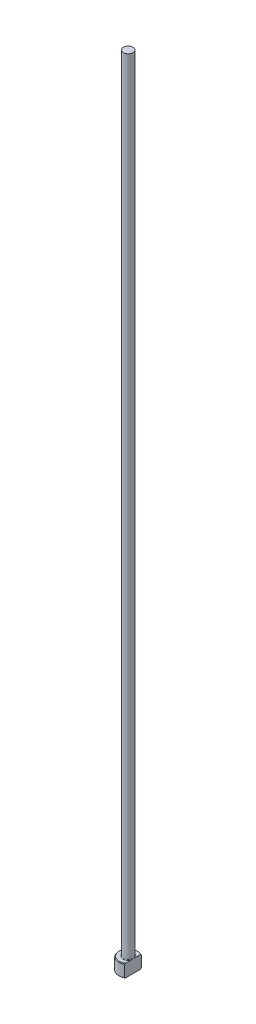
ISO-10303-21;
HEADER;
FILE_DESCRIPTION(('STEP AP214'),'2;1');
FILE_NAME('part.step','',(''),(''),'','','');
FILE_SCHEMA(('AUTOMOTIVE_DESIGN { 1 0 10303 214 1 1 1 1 }'));
ENDSEC;
DATA;
#1=APPLICATION_CONTEXT('core data for automotive mechanical design processes');
#2=APPLICATION_PROTOCOL_DEFINITION('international standard','automotive_design',2000,#1);
#3=PRODUCT_CONTEXT('',#1,'mechanical');
#4=PRODUCT('Part','Part','',(#3));
#5=PRODUCT_RELATED_PRODUCT_CATEGORY('part','',(#4));
#6=PRODUCT_DEFINITION_FORMATION('','',#4);
#7=PRODUCT_DEFINITION_CONTEXT('part definition',#1,'design');
#8=PRODUCT_DEFINITION('design','',#6,#7);
#9=PRODUCT_DEFINITION_SHAPE('','',#8);
#10=(LENGTH_UNIT() NAMED_UNIT(*) SI_UNIT(.MILLI.,.METRE.));
#11=(NAMED_UNIT(*) PLANE_ANGLE_UNIT() SI_UNIT($,.RADIAN.));
#12=(NAMED_UNIT(*) SI_UNIT($,.STERADIAN.) SOLID_ANGLE_UNIT());
#13=UNCERTAINTY_MEASURE_WITH_UNIT(LENGTH_MEASURE(1.E-05),#10,'distance_accuracy_value','');
#14=(GEOMETRIC_REPRESENTATION_CONTEXT(3) GLOBAL_UNCERTAINTY_ASSIGNED_CONTEXT((#13)) GLOBAL_UNIT_ASSIGNED_CONTEXT((#10,
#11,#12)) REPRESENTATION_CONTEXT('',''));
#15=CARTESIAN_POINT('',(0.,0.,0.));
#16=DIRECTION('',(0.,0.,1.));
#17=DIRECTION('',(1.,0.,0.));
#18=AXIS2_PLACEMENT_3D('',#15,#16,#17);
#19=CARTESIAN_POINT('',(0.,0.,0.));
#20=DIRECTION('',(0.,-1.,0.));
#21=DIRECTION('',(0.,0.,-1.));
#22=AXIS2_PLACEMENT_3D('',#19,#20,#21);
#23=PLANE('',#22);
#24=CARTESIAN_POINT('',(0.,0.,0.));
#25=DIRECTION('',(0.,-1.,0.));
#26=DIRECTION('',(0.,0.,-1.));
#27=AXIS2_PLACEMENT_3D('',#24,#25,#26);
#28=CIRCLE('',#27,2.8);
#29=CARTESIAN_POINT('',(1.49999999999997,0.,2.36431808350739));
#30=VERTEX_POINT('',#29);
#31=CARTESIAN_POINT('',(1.49999999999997,0.,-2.36431808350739));
#32=VERTEX_POINT('',#31);
#33=EDGE_CURVE('E98',#30,#32,#28,.T.);
#34=ORIENTED_EDGE('',*,*,#33,.T.);
#35=DIRECTION('',(0.,0.,1.));
#36=VECTOR('',#35,1.);
#37=CARTESIAN_POINT('',(1.49999999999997,0.,2.5980762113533));
#38=LINE('',#37,#36);
#39=EDGE_CURVE('E83',#32,#30,#38,.T.);
#40=ORIENTED_EDGE('',*,*,#39,.T.);
#41=EDGE_LOOP('',(#34,#40));
#42=FACE_BOUND('',#41,.T.);
#43=ADVANCED_FACE('F32',(#42),#23,.T.);
#44=CARTESIAN_POINT('',(0.,259.958771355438,0.));
#45=DIRECTION('',(0.,1.,0.));
#46=DIRECTION('',(0.,0.,1.));
#47=AXIS2_PLACEMENT_3D('',#44,#45,#46);
#48=CYLINDRICAL_SURFACE('',#47,2.99999999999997);
#49=CARTESIAN_POINT('',(0.,3.80000000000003,0.));
#50=DIRECTION('',(0.,1.,0.));
#51=DIRECTION('',(0.,0.,1.));
#52=AXIS2_PLACEMENT_3D('',#49,#50,#51);
#53=CIRCLE('',#52,2.99999999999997);
#54=CARTESIAN_POINT('',(1.49999999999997,3.80000000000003,2.5980762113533));
#55=VERTEX_POINT('',#54);
#56=CARTESIAN_POINT('',(1.49999999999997,3.80000000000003,-2.5980762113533));
#57=VERTEX_POINT('',#56);
#58=EDGE_CURVE('E104',#55,#57,#53,.F.);
#59=ORIENTED_EDGE('',*,*,#58,.T.);
#60=DIRECTION('',(0.,-1.,0.));
#61=VECTOR('',#60,1.);
#62=CARTESIAN_POINT('',(1.49999999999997,250.,-2.5980762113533));
#63=LINE('',#62,#61);
#64=CARTESIAN_POINT('',(1.49999999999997,0.199999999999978,-2.5980762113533));
#65=VERTEX_POINT('',#64);
#66=EDGE_CURVE('E183',#57,#65,#63,.T.);
#67=ORIENTED_EDGE('',*,*,#66,.T.);
#68=CARTESIAN_POINT('',(0.,0.199999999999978,0.));
#69=DIRECTION('',(0.,-1.,0.));
#70=DIRECTION('',(0.,0.,-1.));
#71=AXIS2_PLACEMENT_3D('',#68,#69,#70);
#72=CIRCLE('',#71,2.99999999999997);
#73=CARTESIAN_POINT('',(1.49999999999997,0.199999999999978,2.5980762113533));
#74=VERTEX_POINT('',#73);
#75=EDGE_CURVE('E100',#65,#74,#72,.F.);
#76=ORIENTED_EDGE('',*,*,#75,.T.);
#77=DIRECTION('',(0.,-1.,0.));
#78=VECTOR('',#77,1.);
#79=CARTESIAN_POINT('',(1.49999999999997,250.,2.5980762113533));
#80=LINE('',#79,#78);
#81=EDGE_CURVE('E93',#55,#74,#80,.T.);
#82=ORIENTED_EDGE('',*,*,#81,.F.);
#83=EDGE_LOOP('',(#59,#67,#76,#82));
#84=FACE_BOUND('',#83,.T.);
#85=ADVANCED_FACE('F158',(#84),#48,.T.);
#86=CARTESIAN_POINT('',(-2.99999999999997,4.,0.));
#87=DIRECTION('',(0.,1.,0.));
#88=DIRECTION('',(0.,0.,1.));
#89=AXIS2_PLACEMENT_3D('',#86,#87,#88);
#90=PLANE('',#89);
#91=CARTESIAN_POINT('',(0.,4.,0.));
#92=DIRECTION('',(0.,1.,0.));
#93=DIRECTION('',(0.,0.,1.));
#94=AXIS2_PLACEMENT_3D('',#91,#92,#93);
#95=CIRCLE('',#94,2.80000000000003);
#96=CARTESIAN_POINT('',(1.49999999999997,4.,-2.36431808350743));
#97=VERTEX_POINT('',#96);
#98=CARTESIAN_POINT('',(1.49999999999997,4.,2.36431808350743));
#99=VERTEX_POINT('',#98);
#100=EDGE_CURVE('E178',#97,#99,#95,.T.);
#101=ORIENTED_EDGE('',*,*,#100,.T.);
#102=DIRECTION('',(0.,0.,-1.));
#103=VECTOR('',#102,1.);
#104=CARTESIAN_POINT('',(1.49999999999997,4.,0.));
#105=LINE('',#104,#103);
#106=CARTESIAN_POINT('',(1.49999999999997,3.99999999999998,0.799999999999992));
#107=VERTEX_POINT('',#106);
#108=EDGE_CURVE('E57',#99,#107,#105,.T.);
#109=ORIENTED_EDGE('',*,*,#108,.T.);
#110=CARTESIAN_POINT('',(0.,4.,0.));
#111=DIRECTION('',(0.,1.,0.));
#112=DIRECTION('',(0.,0.,1.));
#113=AXIS2_PLACEMENT_3D('',#110,#111,#112);
#114=CIRCLE('',#113,1.69999999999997);
#115=CARTESIAN_POINT('',(1.49999999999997,3.99999999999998,-0.799999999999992));
#116=VERTEX_POINT('',#115);
#117=EDGE_CURVE('E107',#107,#116,#114,.F.);
#118=ORIENTED_EDGE('',*,*,#117,.T.);
#119=EDGE_CURVE('E136',#116,#97,#105,.T.);
#120=ORIENTED_EDGE('',*,*,#119,.T.);
#121=EDGE_LOOP('',(#101,#109,#118,#120));
#122=FACE_BOUND('',#121,.T.);
#123=ADVANCED_FACE('F147',(#122),#90,.T.);
#124=CARTESIAN_POINT('',(0.,4.,0.));
#125=DIRECTION('',(0.,-1.,0.));
#126=DIRECTION('',(0.,0.,-1.));
#127=AXIS2_PLACEMENT_3D('',#124,#125,#126);
#128=CONICAL_SURFACE('',#127,2.80000000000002,0.785398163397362);
#129=ORIENTED_EDGE('',*,*,#58,.F.);
#130=CARTESIAN_POINT('',(1.49999999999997,0.888258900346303,5.71827621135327));
#131=CARTESIAN_POINT('',(1.49999999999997,1.01361833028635,5.58866816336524));
#132=CARTESIAN_POINT('',(1.49999999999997,1.13884324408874,5.45892957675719));
#133=CARTESIAN_POINT('',(1.49999999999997,1.38894444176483,5.19911365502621));
#134=CARTESIAN_POINT('',(1.49999999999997,1.51382072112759,5.0690363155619));
#135=CARTESIAN_POINT('',(1.49999999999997,1.76320568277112,4.80840180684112));
#136=CARTESIAN_POINT('',(1.49999999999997,1.88771414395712,4.67784442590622));
#137=CARTESIAN_POINT('',(1.49999999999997,2.13618059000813,4.41620813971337));
#138=CARTESIAN_POINT('',(1.49999999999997,2.26013857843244,4.28512923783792));
#139=CARTESIAN_POINT('',(1.49999999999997,2.50488975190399,4.02490837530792));
#140=CARTESIAN_POINT('',(1.49999999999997,2.62569693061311,3.89577958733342));
#141=CARTESIAN_POINT('',(1.49999999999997,2.86640694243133,3.63668213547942));
#142=CARTESIAN_POINT('',(1.49999999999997,2.98630978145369,3.50671347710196));
#143=CARTESIAN_POINT('',(1.49999999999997,3.2248603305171,3.24567921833));
#144=CARTESIAN_POINT('',(1.49999999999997,3.34350830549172,3.11461386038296));
#145=CARTESIAN_POINT('',(1.49999999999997,3.57907716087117,2.85094268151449));
#146=CARTESIAN_POINT('',(1.49999999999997,3.69599811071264,2.71833692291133));
#147=CARTESIAN_POINT('',(1.49999999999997,3.88262371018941,2.50255231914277));
#148=CARTESIAN_POINT('',(1.49999999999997,3.95312454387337,2.42006293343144));
#149=CARTESIAN_POINT('',(1.49999999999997,4.0928709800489,2.25401084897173));
#150=CARTESIAN_POINT('',(1.49999999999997,4.16211645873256,2.17044804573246));
#151=CARTESIAN_POINT('',(1.49999999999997,4.29964684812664,2.00105967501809));
#152=CARTESIAN_POINT('',(1.49999999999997,4.36791386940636,1.91521952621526));
#153=CARTESIAN_POINT('',(1.49999999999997,4.50205840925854,1.74171392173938));
#154=CARTESIAN_POINT('',(1.49999999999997,4.56793649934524,1.65404891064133));
#155=CARTESIAN_POINT('',(1.49999999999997,4.69728151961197,1.47490236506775));
#156=CARTESIAN_POINT('',(1.49999999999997,4.76069661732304,1.3833830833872));
#157=CARTESIAN_POINT('',(1.49999999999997,4.88239539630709,1.19675661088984));
#158=CARTESIAN_POINT('',(1.49999999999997,4.94067201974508,1.10164473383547));
#159=CARTESIAN_POINT('',(1.49999999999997,5.04841325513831,0.908008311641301));
#160=CARTESIAN_POINT('',(1.49999999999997,5.09797809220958,0.809540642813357));
#161=CARTESIAN_POINT('',(1.49999999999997,5.18432188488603,0.607192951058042));
#162=CARTESIAN_POINT('',(1.49999999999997,5.22114374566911,0.503332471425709));
#163=CARTESIAN_POINT('',(1.49999999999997,5.26099935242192,0.347577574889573));
#164=CARTESIAN_POINT('',(1.49999999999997,5.27157029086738,0.297609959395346));
#165=CARTESIAN_POINT('',(1.49999999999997,5.28794860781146,0.19688506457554));
#166=CARTESIAN_POINT('',(1.49999999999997,5.29375640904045,0.146127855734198));
#167=CARTESIAN_POINT('',(1.49999999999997,5.30019707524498,0.0444388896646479));
#168=CARTESIAN_POINT('',(1.49999999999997,5.30084594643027,-0.00649183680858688));
#169=CARTESIAN_POINT('',(1.49999999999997,5.29696416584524,-0.108155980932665));
#170=CARTESIAN_POINT('',(1.49999999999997,5.29243308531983,-0.158889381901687));
#171=CARTESIAN_POINT('',(1.49999999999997,5.27856915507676,-0.259234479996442));
#172=CARTESIAN_POINT('',(1.49999999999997,5.26927821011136,-0.308852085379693));
#173=CARTESIAN_POINT('',(1.49999999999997,5.24647108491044,-0.407110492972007));
#174=CARTESIAN_POINT('',(1.49999999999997,5.23295324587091,-0.455750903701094));
#175=CARTESIAN_POINT('',(1.49999999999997,5.20226175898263,-0.552149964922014));
#176=CARTESIAN_POINT('',(1.49999999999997,5.18506801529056,-0.599902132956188));
#177=CARTESIAN_POINT('',(1.49999999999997,5.14771387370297,-0.694205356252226));
#178=CARTESIAN_POINT('',(1.49999999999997,5.12755408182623,-0.740756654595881));
#179=CARTESIAN_POINT('',(1.49999999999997,5.06327696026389,-0.879166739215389));
#180=CARTESIAN_POINT('',(1.49999999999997,5.01551721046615,-0.969329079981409));
#181=CARTESIAN_POINT('',(1.49999999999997,4.91367909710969,-1.14604316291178));
#182=CARTESIAN_POINT('',(1.49999999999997,4.85959300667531,-1.23259031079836));
#183=CARTESIAN_POINT('',(1.49999999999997,4.74697968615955,-1.40321348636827));
#184=CARTESIAN_POINT('',(1.49999999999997,4.68843573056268,-1.48727838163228));
#185=CARTESIAN_POINT('',(1.49999999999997,4.56843845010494,-1.65322187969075));
#186=CARTESIAN_POINT('',(1.49999999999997,4.50698656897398,-1.73510153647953));
#187=CARTESIAN_POINT('',(1.49999999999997,4.3811567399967,-1.89829823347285));
#188=CARTESIAN_POINT('',(1.49999999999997,4.31675092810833,-1.97959369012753));
#189=CARTESIAN_POINT('',(1.49999999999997,4.18634068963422,-2.14090082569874));
#190=CARTESIAN_POINT('',(1.49999999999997,4.12033609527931,-2.22091236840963));
#191=CARTESIAN_POINT('',(1.49999999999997,3.92086431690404,-2.4590650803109));
#192=CARTESIAN_POINT('',(1.49999999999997,3.78562663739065,-2.61572090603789));
#193=CARTESIAN_POINT('',(1.49999999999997,3.53554498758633,-2.90006295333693));
#194=CARTESIAN_POINT('',(1.49999999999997,3.42114543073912,-3.02814382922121));
#195=CARTESIAN_POINT('',(1.49999999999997,3.19093557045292,-3.28303767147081));
#196=CARTESIAN_POINT('',(1.49999999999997,3.07512522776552,-3.40985060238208));
#197=CARTESIAN_POINT('',(1.49999999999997,2.72597067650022,-3.7891384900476));
#198=CARTESIAN_POINT('',(1.49999999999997,2.49111760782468,-4.04022177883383));
#199=CARTESIAN_POINT('',(1.49999999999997,2.02882478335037,-4.52992803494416));
#200=CARTESIAN_POINT('',(1.49999999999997,1.80147747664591,-4.76863870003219));
#201=CARTESIAN_POINT('',(1.49999999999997,1.45954865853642,-5.12558036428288));
#202=CARTESIAN_POINT('',(1.49999999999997,1.34548484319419,-5.24430773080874));
#203=CARTESIAN_POINT('',(1.49999999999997,1.11707176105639,-5.48148573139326));
#204=CARTESIAN_POINT('',(1.49999999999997,1.00272249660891,-5.59993636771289));
#205=CARTESIAN_POINT('',(1.49999999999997,0.888258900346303,-5.71827621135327));
#206=B_SPLINE_CURVE_WITH_KNOTS('',3,(#130,#131,#132,#133,#134,#135,#136,#137,#138,#139,#140,
#141,#142,#143,#144,#145,#146,#147,#148,#149,#150,#151,#152,#153,#154,#155,#156,#157,#158,#159,
#160,#161,#162,#163,#164,#165,#166,#167,#168,#169,#170,#171,#172,#173,#174,#175,#176,#177,#178,
#179,#180,#181,#182,#183,#184,#185,#186,#187,#188,#189,#190,#191,#192,#193,#194,#195,#196,#197,
#198,#199,#200,#201,#202,#203,#204,#205),.UNSPECIFIED.,.F.,.F.,(4,2,2,2,2,2,2,2,2,2,2,2,2,2,2,2,
2,2,2,2,2,2,2,2,2,2,2,2,2,2,2,2,2,2,2,2,2,4),(0.,0.540943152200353,1.08189327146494,
1.62312052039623,2.16434426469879,2.69482920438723,3.22531067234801,3.75567781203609,
4.28602356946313,4.61155053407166,4.93710943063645,5.26610945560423,5.59503024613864,
5.92894782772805,6.26331713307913,6.59354403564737,6.92264800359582,7.07567478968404,
7.22868799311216,7.38122626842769,7.53377717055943,7.68500755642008,7.83629736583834,
7.98843643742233,8.14054446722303,8.44618799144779,8.75220879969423,9.05944044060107,
9.3665211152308,9.67764287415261,9.98879742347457,10.6095925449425,11.1247803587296,
11.6399825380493,12.6713544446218,13.6603005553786,14.1542238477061,14.6481430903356),.UNSPECIFIED.);
#207=EDGE_CURVE('E135',#55,#99,#206,.T.);
#208=ORIENTED_EDGE('',*,*,#207,.T.);
#209=ORIENTED_EDGE('',*,*,#100,.F.);
#210=EDGE_CURVE('E127',#97,#57,#206,.T.);
#211=ORIENTED_EDGE('',*,*,#210,.T.);
#212=EDGE_LOOP('',(#129,#208,#209,#211));
#213=FACE_BOUND('',#212,.T.);
#214=ADVANCED_FACE('F143',(#213),#128,.T.);
#215=CARTESIAN_POINT('',(0.,0.199999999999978,0.));
#216=DIRECTION('',(0.,1.,0.));
#217=DIRECTION('',(0.,0.,1.));
#218=AXIS2_PLACEMENT_3D('',#215,#216,#217);
#219=CONICAL_SURFACE('',#218,2.99999999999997,0.785398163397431);
#220=ORIENTED_EDGE('',*,*,#75,.F.);
#221=CARTESIAN_POINT('',(1.49999999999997,3.1117410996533,-5.71827621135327));
#222=CARTESIAN_POINT('',(1.49999999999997,2.98638166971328,-5.58866816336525));
#223=CARTESIAN_POINT('',(1.49999999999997,2.86115675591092,-5.45892957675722));
#224=CARTESIAN_POINT('',(1.49999999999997,2.61105555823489,-5.19911365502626));
#225=CARTESIAN_POINT('',(1.49999999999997,2.48617927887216,-5.06903631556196));
#226=CARTESIAN_POINT('',(1.49999999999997,2.23679431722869,-4.8084018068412));
#227=CARTESIAN_POINT('',(1.49999999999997,2.11228585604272,-4.67784442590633));
#228=CARTESIAN_POINT('',(1.49999999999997,1.86381940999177,-4.4162081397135));
#229=CARTESIAN_POINT('',(1.49999999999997,1.73986142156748,-4.28512923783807));
#230=CARTESIAN_POINT('',(1.49999999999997,1.49511024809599,-4.02490837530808));
#231=CARTESIAN_POINT('',(1.49999999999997,1.3743030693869,-3.8957795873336));
#232=CARTESIAN_POINT('',(1.49999999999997,1.13359305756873,-3.63668213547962));
#233=CARTESIAN_POINT('',(1.49999999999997,1.0136902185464,-3.50671347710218));
#234=CARTESIAN_POINT('',(1.49999999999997,0.775139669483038,-3.24567921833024));
#235=CARTESIAN_POINT('',(1.49999999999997,0.656491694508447,-3.11461386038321));
#236=CARTESIAN_POINT('',(1.49999999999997,0.420922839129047,-2.85094268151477));
#237=CARTESIAN_POINT('',(1.49999999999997,0.304001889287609,-2.71833692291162));
#238=CARTESIAN_POINT('',(1.49999999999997,0.117376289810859,-2.50255231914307));
#239=CARTESIAN_POINT('',(1.49999999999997,0.0468754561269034,-2.42006293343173));
#240=CARTESIAN_POINT('',(1.49999999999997,-0.0928709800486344,-2.254010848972));
#241=CARTESIAN_POINT('',(1.49999999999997,-0.162116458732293,-2.17044804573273));
#242=CARTESIAN_POINT('',(1.49999999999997,-0.299646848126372,-2.00105967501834));
#243=CARTESIAN_POINT('',(1.49999999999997,-0.367913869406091,-1.9152195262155));
#244=CARTESIAN_POINT('',(1.49999999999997,-0.502058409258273,-1.7417139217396));
#245=CARTESIAN_POINT('',(1.49999999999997,-0.567936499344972,-1.65404891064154));
#246=CARTESIAN_POINT('',(1.49999999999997,-0.697281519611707,-1.47490236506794));
#247=CARTESIAN_POINT('',(1.49999999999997,-0.76069661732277,-1.38338308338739));
#248=CARTESIAN_POINT('',(1.49999999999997,-0.882395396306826,-1.19675661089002));
#249=CARTESIAN_POINT('',(1.49999999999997,-0.940672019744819,-1.10164473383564));
#250=CARTESIAN_POINT('',(1.49999999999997,-1.04841325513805,-0.908008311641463));
#251=CARTESIAN_POINT('',(1.49999999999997,-1.09797809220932,-0.809540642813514));
#252=CARTESIAN_POINT('',(1.49999999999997,-1.18432188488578,-0.607192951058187));
#253=CARTESIAN_POINT('',(1.49999999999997,-1.22114374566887,-0.503332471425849));
#254=CARTESIAN_POINT('',(1.49999999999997,-1.26099935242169,-0.347577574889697));
#255=CARTESIAN_POINT('',(1.49999999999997,-1.27157029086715,-0.297609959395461));
#256=CARTESIAN_POINT('',(1.49999999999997,-1.28794860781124,-0.196885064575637));
#257=CARTESIAN_POINT('',(1.49999999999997,-1.29375640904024,-0.146127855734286));
#258=CARTESIAN_POINT('',(1.49999999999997,-1.30019707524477,-0.0444388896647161));
#259=CARTESIAN_POINT('',(1.49999999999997,-1.30084594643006,0.00649183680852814));
#260=CARTESIAN_POINT('',(1.49999999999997,-1.29696416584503,0.108155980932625));
#261=CARTESIAN_POINT('',(1.49999999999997,-1.29243308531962,0.158889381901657));
#262=CARTESIAN_POINT('',(1.49999999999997,-1.27856915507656,0.259234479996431));
#263=CARTESIAN_POINT('',(1.49999999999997,-1.26927821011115,0.308852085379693));
#264=CARTESIAN_POINT('',(1.49999999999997,-1.24647108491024,0.407110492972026));
#265=CARTESIAN_POINT('',(1.49999999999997,-1.2329532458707,0.455750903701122));
#266=CARTESIAN_POINT('',(1.49999999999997,-1.20226175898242,0.552149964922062));
#267=CARTESIAN_POINT('',(1.49999999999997,-1.18506801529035,0.599902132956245));
#268=CARTESIAN_POINT('',(1.49999999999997,-1.14771387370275,0.694205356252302));
#269=CARTESIAN_POINT('',(1.49999999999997,-1.12755408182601,0.740756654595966));
#270=CARTESIAN_POINT('',(1.49999999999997,-1.06327696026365,0.879166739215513));
#271=CARTESIAN_POINT('',(1.49999999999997,-1.0155172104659,0.969329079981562));
#272=CARTESIAN_POINT('',(1.49999999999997,-0.913679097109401,1.14604316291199));
#273=CARTESIAN_POINT('',(1.49999999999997,-0.859593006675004,1.2325903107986));
#274=CARTESIAN_POINT('',(1.49999999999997,-0.746979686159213,1.40321348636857));
#275=CARTESIAN_POINT('',(1.49999999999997,-0.688435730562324,1.4872783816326));
#276=CARTESIAN_POINT('',(1.49999999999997,-0.56843845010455,1.65322187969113));
#277=CARTESIAN_POINT('',(1.49999999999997,-0.506986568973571,1.73510153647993));
#278=CARTESIAN_POINT('',(1.49999999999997,-0.381156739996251,1.89829823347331));
#279=CARTESIAN_POINT('',(1.49999999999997,-0.316750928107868,1.97959369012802));
#280=CARTESIAN_POINT('',(1.49999999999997,-0.186340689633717,2.14090082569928));
#281=CARTESIAN_POINT('',(1.49999999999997,-0.120336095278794,2.2209123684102));
#282=CARTESIAN_POINT('',(1.49999999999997,0.0791356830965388,2.45906508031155));
#283=CARTESIAN_POINT('',(1.49999999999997,0.214373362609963,2.6157209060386));
#284=CARTESIAN_POINT('',(1.49999999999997,0.464455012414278,2.90006295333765));
#285=CARTESIAN_POINT('',(1.49999999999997,0.578854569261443,3.02814382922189));
#286=CARTESIAN_POINT('',(1.49999999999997,0.809064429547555,3.28303767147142));
#287=CARTESIAN_POINT('',(1.49999999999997,0.92487477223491,3.40985060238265));
#288=CARTESIAN_POINT('',(1.49999999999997,1.27402932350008,3.78913849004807));
#289=CARTESIAN_POINT('',(1.49999999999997,1.50888239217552,4.04022177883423));
#290=CARTESIAN_POINT('',(1.49999999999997,1.97117521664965,4.52992803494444));
#291=CARTESIAN_POINT('',(1.49999999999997,2.19852252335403,4.76863870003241));
#292=CARTESIAN_POINT('',(1.49999999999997,2.54045134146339,5.12558036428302));
#293=CARTESIAN_POINT('',(1.49999999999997,2.65451515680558,5.24430773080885));
#294=CARTESIAN_POINT('',(1.49999999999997,2.8829282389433,5.48148573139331));
#295=CARTESIAN_POINT('',(1.49999999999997,2.99727750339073,5.59993636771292));
#296=CARTESIAN_POINT('',(1.49999999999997,3.1117410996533,5.71827621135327));
#297=B_SPLINE_CURVE_WITH_KNOTS('',3,(#221,#222,#223,#224,#225,#226,#227,#228,#229,#230,#231,
#232,#233,#234,#235,#236,#237,#238,#239,#240,#241,#242,#243,#244,#245,#246,#247,#248,#249,#250,
#251,#252,#253,#254,#255,#256,#257,#258,#259,#260,#261,#262,#263,#264,#265,#266,#267,#268,#269,
#270,#271,#272,#273,#274,#275,#276,#277,#278,#279,#280,#281,#282,#283,#284,#285,#286,#287,#288,
#289,#290,#291,#292,#293,#294,#295,#296),.UNSPECIFIED.,.F.,.F.,(4,2,2,2,2,2,2,2,2,2,2,2,2,2,2,2,
2,2,2,2,2,2,2,2,2,2,2,2,2,2,2,2,2,2,2,2,2,4),(0.,0.540943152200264,1.08189327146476,
1.62312052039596,2.16434426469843,2.69482920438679,3.22531067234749,3.75567781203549,
4.28602356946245,4.611550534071,4.9371094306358,5.26610945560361,5.59503024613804,
5.92894782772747,6.26331713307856,6.59354403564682,6.92264800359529,7.07567478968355,
7.2286879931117,7.38122626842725,7.53377717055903,7.6850075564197,7.83629736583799,
7.98843643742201,8.14054446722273,8.44618799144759,8.75220879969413,9.05944044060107,
9.3665211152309,9.67764287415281,9.98879742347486,10.609592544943,11.1247803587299,
11.6399825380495,12.6713544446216,13.6603005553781,14.1542238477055,14.6481430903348),.UNSPECIFIED.);
#298=EDGE_CURVE('E86',#65,#32,#297,.T.);
#299=ORIENTED_EDGE('',*,*,#298,.T.);
#300=ORIENTED_EDGE('',*,*,#33,.F.);
#301=EDGE_CURVE('E89',#30,#74,#297,.T.);
#302=ORIENTED_EDGE('',*,*,#301,.T.);
#303=EDGE_LOOP('',(#220,#299,#300,#302));
#304=FACE_BOUND('',#303,.T.);
#305=ADVANCED_FACE('F97',(#304),#219,.T.);
#306=CARTESIAN_POINT('',(0.,4.19999999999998,0.));
#307=DIRECTION('',(0.,1.,0.));
#308=DIRECTION('',(0.,0.,1.));
#309=AXIS2_PLACEMENT_3D('',#306,#307,#308);
#310=TOROIDAL_SURFACE('',#309,1.69999999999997,0.2);
#311=CARTESIAN_POINT('',(1.49999999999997,4.19999999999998,0.));
#312=CARTESIAN_POINT('',(1.49999999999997,4.20000050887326,7.14686072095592E-11));
#313=CARTESIAN_POINT('',(1.49999999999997,4.20000101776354,-1.21663673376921E-07));
#314=CARTESIAN_POINT('',(1.49999999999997,4.20000199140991,-4.97616237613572E-07));
#315=CARTESIAN_POINT('',(1.49999999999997,4.20000245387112,-7.5651622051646E-07));
#316=CARTESIAN_POINT('',(1.49999999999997,4.20000338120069,-1.37642837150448E-06));
#317=CARTESIAN_POINT('',(1.49999999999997,4.20000384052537,-1.74563476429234E-06));
#318=CARTESIAN_POINT('',(1.49999999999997,4.20000469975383,-2.53565984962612E-06));
#319=CARTESIAN_POINT('',(1.49999999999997,4.20000510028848,-2.95582597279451E-06));
#320=CARTESIAN_POINT('',(1.49999999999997,4.20000646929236,-4.48430445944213E-06));
#321=CARTESIAN_POINT('',(1.49999999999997,4.20000736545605,-5.65861039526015E-06));
#322=CARTESIAN_POINT('',(1.49999999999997,4.20000893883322,-8.06479202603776E-06));
#323=CARTESIAN_POINT('',(1.49999999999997,4.20000962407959,-9.29170517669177E-06));
#324=CARTESIAN_POINT('',(1.49999999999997,4.20001225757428,-1.416232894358E-05));
#325=CARTESIAN_POINT('',(1.49999999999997,4.20001407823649,-1.78790031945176E-05));
#326=CARTESIAN_POINT('',(1.49999999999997,4.20001699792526,-2.51443066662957E-05));
#327=CARTESIAN_POINT('',(1.49999999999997,4.20001815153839,-2.86715394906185E-05));
#328=CARTESIAN_POINT('',(1.49999999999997,4.20002315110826,-4.39218128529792E-05));
#329=CARTESIAN_POINT('',(1.49999999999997,4.20002701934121,-5.56288390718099E-05));
#330=CARTESIAN_POINT('',(1.49999999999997,4.20003312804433,-7.7405829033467E-05));
#331=CARTESIAN_POINT('',(1.49999999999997,4.20003553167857,-8.7427841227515E-05));
#332=CARTESIAN_POINT('',(1.49999999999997,4.20005483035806,-0.000161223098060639));
#333=CARTESIAN_POINT('',(1.49999999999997,4.20007979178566,-0.000222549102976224));
#334=CARTESIAN_POINT('',(1.49999999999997,4.20017391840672,-0.000462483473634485));
#335=CARTESIAN_POINT('',(1.49999999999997,4.20023706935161,-0.000642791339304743));
#336=CARTESIAN_POINT('',(1.49999999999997,4.20048761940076,-0.00134785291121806));
#337=CARTESIAN_POINT('',(1.49999999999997,4.20068132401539,-0.00187087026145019));
#338=CARTESIAN_POINT('',(1.49999999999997,4.20147357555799,-0.00402004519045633));
#339=CARTESIAN_POINT('',(1.49999999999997,4.20206499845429,-0.00564811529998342));
#340=CARTESIAN_POINT('',(1.49999999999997,4.20892634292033,-0.0245232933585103));
#341=CARTESIAN_POINT('',(1.49999999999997,4.21523683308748,-0.0417598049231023));
#342=CARTESIAN_POINT('',(1.49999999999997,4.22755028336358,-0.0756091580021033));
#343=CARTESIAN_POINT('',(1.49999999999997,4.23355589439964,-0.0922211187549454));
#344=CARTESIAN_POINT('',(1.49999999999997,4.24620101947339,-0.12745424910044));
#345=CARTESIAN_POINT('',(1.49999999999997,4.25283080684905,-0.146078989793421));
#346=CARTESIAN_POINT('',(1.49999999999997,4.26599765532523,-0.183577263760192));
#347=CARTESIAN_POINT('',(1.49999999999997,4.27253305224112,-0.202451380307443));
#348=CARTESIAN_POINT('',(1.49999999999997,4.28834228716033,-0.248982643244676));
#349=CARTESIAN_POINT('',(1.49999999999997,4.2974915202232,-0.276682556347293));
#350=CARTESIAN_POINT('',(1.49999999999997,4.31490935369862,-0.331625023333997));
#351=CARTESIAN_POINT('',(1.49999999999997,4.32319386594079,-0.35886250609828));
#352=CARTESIAN_POINT('',(1.49999999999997,4.34051594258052,-0.419125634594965));
#353=CARTESIAN_POINT('',(1.49999999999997,4.34936607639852,-0.452206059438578));
#354=CARTESIAN_POINT('',(1.49999999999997,4.36549583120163,-0.519023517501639));
#355=CARTESIAN_POINT('',(1.49999999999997,4.37276283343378,-0.55276364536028));
#356=CARTESIAN_POINT('',(1.49999999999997,4.38554755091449,-0.623053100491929));
#357=CARTESIAN_POINT('',(1.49999999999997,4.39090573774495,-0.659632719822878));
#358=CARTESIAN_POINT('',(1.49999999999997,4.39825016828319,-0.733028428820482));
#359=CARTESIAN_POINT('',(1.49999999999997,4.40024734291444,-0.769843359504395));
#360=CARTESIAN_POINT('',(1.49999999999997,4.39970780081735,-0.842856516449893));
#361=CARTESIAN_POINT('',(1.49999999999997,4.39725347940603,-0.87905368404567));
#362=CARTESIAN_POINT('',(1.49999999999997,4.38900085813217,-0.932380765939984));
#363=CARTESIAN_POINT('',(1.49999999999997,4.38553049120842,-0.949868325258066));
#364=CARTESIAN_POINT('',(1.49999999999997,4.37678336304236,-0.984374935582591));
#365=CARTESIAN_POINT('',(1.49999999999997,4.37150943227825,-1.00139467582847));
#366=CARTESIAN_POINT('',(1.49999999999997,4.35869781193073,-1.03479423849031));
#367=CARTESIAN_POINT('',(1.49999999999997,4.3511359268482,-1.05116499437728));
#368=CARTESIAN_POINT('',(1.49999999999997,4.33325333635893,-1.08234828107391));
#369=CARTESIAN_POINT('',(1.49999999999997,4.32294266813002,-1.097166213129));
#370=CARTESIAN_POINT('',(1.49999999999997,4.30512758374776,-1.11714173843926));
#371=CARTESIAN_POINT('',(1.49999999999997,4.29884721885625,-1.1233906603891));
#372=CARTESIAN_POINT('',(1.49999999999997,4.28545950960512,-1.13494695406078));
#373=CARTESIAN_POINT('',(1.49999999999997,4.27835226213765,-1.14025443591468));
#374=CARTESIAN_POINT('',(1.49999999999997,4.26325970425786,-1.14967631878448));
#375=CARTESIAN_POINT('',(1.49999999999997,4.25526534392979,-1.1537764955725));
#376=CARTESIAN_POINT('',(1.49999999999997,4.23863207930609,-1.16034952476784));
#377=CARTESIAN_POINT('',(1.49999999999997,4.22999427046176,-1.16282507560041));
#378=CARTESIAN_POINT('',(1.49999999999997,4.21343922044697,-1.16570267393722));
#379=CARTESIAN_POINT('',(1.49999999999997,4.20555896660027,-1.16631687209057));
#380=CARTESIAN_POINT('',(1.49999999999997,4.18982775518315,-1.16602054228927));
#381=CARTESIAN_POINT('',(1.49999999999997,4.18197679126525,-1.16511036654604));
#382=CARTESIAN_POINT('',(1.49999999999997,4.16747846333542,-1.16204446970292));
#383=CARTESIAN_POINT('',(1.49999999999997,4.16079696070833,-1.16004509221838));
#384=CARTESIAN_POINT('',(1.49999999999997,4.14781700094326,-1.15505972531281));
#385=CARTESIAN_POINT('',(1.49999999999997,4.14151862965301,-1.1520735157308));
#386=CARTESIAN_POINT('',(1.49999999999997,4.12690214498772,-1.14387585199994));
#387=CARTESIAN_POINT('',(1.49999999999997,4.11881436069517,-1.13825400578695));
#388=CARTESIAN_POINT('',(1.49999999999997,4.10364440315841,-1.12578441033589));
#389=CARTESIAN_POINT('',(1.49999999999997,4.09656475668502,-1.11893367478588));
#390=CARTESIAN_POINT('',(1.49999999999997,4.08012297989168,-1.10074342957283));
#391=CARTESIAN_POINT('',(1.49999999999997,4.07136543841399,-1.08886044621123));
#392=CARTESIAN_POINT('',(1.49999999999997,4.05578194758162,-1.06392743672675));
#393=CARTESIAN_POINT('',(1.49999999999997,4.0489571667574,-1.05087671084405));
#394=CARTESIAN_POINT('',(1.49999999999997,4.03273856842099,-1.0147230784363));
#395=CARTESIAN_POINT('',(1.49999999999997,4.02486230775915,-0.990945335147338));
#396=CARTESIAN_POINT('',(1.49999999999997,4.01257693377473,-0.942321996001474));
#397=CARTESIAN_POINT('',(1.49999999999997,4.00820590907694,-0.917467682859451));
#398=CARTESIAN_POINT('',(1.49999999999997,4.00229956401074,-0.867912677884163));
#399=CARTESIAN_POINT('',(1.49999999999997,4.0007128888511,-0.843217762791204));
#400=CARTESIAN_POINT('',(1.49999999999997,3.9996723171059,-0.793746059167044));
#401=CARTESIAN_POINT('',(1.49999999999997,4.0002230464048,-0.768969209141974));
#402=CARTESIAN_POINT('',(1.49999999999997,4.00433101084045,-0.696994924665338));
#403=CARTESIAN_POINT('',(1.49999999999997,4.01016976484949,-0.649931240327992));
#404=CARTESIAN_POINT('',(1.49999999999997,4.02567776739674,-0.559166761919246));
#405=CARTESIAN_POINT('',(1.49999999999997,4.03511950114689,-0.515423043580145));
#406=CARTESIAN_POINT('',(1.49999999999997,4.05693059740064,-0.427590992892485));
#407=CARTESIAN_POINT('',(1.49999999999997,4.06936356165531,-0.383518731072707));
#408=CARTESIAN_POINT('',(1.49999999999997,4.09174953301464,-0.310161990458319));
#409=CARTESIAN_POINT('',(1.49999999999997,4.10119843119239,-0.280718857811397));
#410=CARTESIAN_POINT('',(1.49999999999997,4.12060442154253,-0.222340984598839));
#411=CARTESIAN_POINT('',(1.49999999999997,4.13055519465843,-0.193404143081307));
#412=CARTESIAN_POINT('',(1.49999999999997,4.14973721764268,-0.138756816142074));
#413=CARTESIAN_POINT('',(1.49999999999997,4.15893123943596,-0.113033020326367));
#414=CARTESIAN_POINT('',(1.49999999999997,4.1778803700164,-0.0606351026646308));
#415=CARTESIAN_POINT('',(1.49999999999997,4.18764328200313,-0.0339636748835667));
#416=CARTESIAN_POINT('',(1.49999999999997,4.19793548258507,-0.00564657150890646));
#417=CARTESIAN_POINT('',(1.49999999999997,4.19852751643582,-0.00401699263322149));
#418=CARTESIAN_POINT('',(1.49999999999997,4.19931992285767,-0.00186745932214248));
#419=CARTESIAN_POINT('',(1.49999999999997,4.1995131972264,-0.00134559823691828));
#420=CARTESIAN_POINT('',(1.49999999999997,4.19976322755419,-0.000641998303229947));
#421=CARTESIAN_POINT('',(1.49999999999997,4.19982627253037,-0.000461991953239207));
#422=CARTESIAN_POINT('',(1.49999999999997,4.19992025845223,-0.000222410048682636));
#423=CARTESIAN_POINT('',(1.49999999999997,4.19994519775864,-0.000161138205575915));
#424=CARTESIAN_POINT('',(1.49999999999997,4.19996448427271,-8.74039267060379E-05));
#425=CARTESIAN_POINT('',(1.49999999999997,4.19996688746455,-7.73857556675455E-05));
#426=CARTESIAN_POINT('',(1.49999999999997,4.19997299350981,-5.56173272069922E-05));
#427=CARTESIAN_POINT('',(1.49999999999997,4.19997685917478,-4.39149186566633E-05));
#428=CARTESIAN_POINT('',(1.49999999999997,4.19998185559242,-2.86698156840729E-05));
#429=CARTESIAN_POINT('',(1.49999999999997,4.19998300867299,-2.51431575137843E-05));
#430=CARTESIAN_POINT('',(1.49999999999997,4.19998592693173,-1.78789552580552E-05));
#431=CARTESIAN_POINT('',(1.49999999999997,4.19998774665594,-1.41627846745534E-05));
#432=CARTESIAN_POINT('',(1.49999999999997,4.19999037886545,-9.29264488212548E-06));
#433=CARTESIAN_POINT('',(1.49999999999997,4.19999106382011,-8.06577599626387E-06));
#434=CARTESIAN_POINT('',(1.49999999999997,4.19999263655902,-5.65962639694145E-06));
#435=CARTESIAN_POINT('',(1.49999999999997,4.19999353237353,-4.48530466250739E-06));
#436=CARTESIAN_POINT('',(1.49999999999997,4.19999490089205,-2.95673740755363E-06));
#437=CARTESIAN_POINT('',(1.49999999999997,4.1999953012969,-2.53653208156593E-06));
#438=CARTESIAN_POINT('',(1.49999999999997,4.19999616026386,-1.74640525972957E-06));
#439=CARTESIAN_POINT('',(1.49999999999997,4.19999661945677,-1.37713598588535E-06));
#440=CARTESIAN_POINT('',(1.49999999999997,4.19999754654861,-7.57072336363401E-07));
#441=CARTESIAN_POINT('',(1.49999999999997,4.19999800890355,-4.98087387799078E-07));
#442=CARTESIAN_POINT('',(1.49999999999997,4.19999898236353,-1.21927250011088E-07));
#443=CARTESIAN_POINT('',(1.49999999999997,4.19999949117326,-7.14620692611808E-11));
#444=CARTESIAN_POINT('',(1.49999999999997,4.19999999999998,0.));
#445=B_SPLINE_CURVE_WITH_KNOTS('',3,(#311,#312,#313,#314,#315,#316,#317,#318,#319,#320,#321,
#322,#323,#324,#325,#326,#327,#328,#329,#330,#331,#332,#333,#334,#335,#336,#337,#338,#339,#340,
#341,#342,#343,#344,#345,#346,#347,#348,#349,#350,#351,#352,#353,#354,#355,#356,#357,#358,#359,
#360,#361,#362,#363,#364,#365,#366,#367,#368,#369,#370,#371,#372,#373,#374,#375,#376,#377,#378,
#379,#380,#381,#382,#383,#384,#385,#386,#387,#388,#389,#390,#391,#392,#393,#394,#395,#396,#397,
#398,#399,#400,#401,#402,#403,#404,#405,#406,#407,#408,#409,#410,#411,#412,#413,#414,#415,#416,
#417,#418,#419,#420,#421,#422,#423,#424,#425,#426,#427,#428,#429,#430,#431,#432,#433,#434,#435,
#436,#437,#438,#439,#440,#441,#442,#443,#444),.UNSPECIFIED.,.T.,.F.,(4,2,2,2,2,2,2,2,2,2,2,2,2,
2,2,2,2,2,2,2,2,2,2,2,2,2,2,2,2,2,2,2,2,2,2,2,2,2,2,2,2,2,2,2,2,2,2,2,2,2,2,2,2,2,2,2,2,2,2,2,2,
2,2,2,2,2,4),(0.,1.5268750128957E-06,3.10959387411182E-06,4.86976756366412E-06,
6.60940084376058E-06,1.10202525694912E-05,1.5232779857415E-05,2.76140371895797E-05,
3.87351645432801E-05,7.5718833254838E-05,0.000106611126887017,0.000304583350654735,
0.000878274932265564,0.00255078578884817,0.00774802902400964,0.0628090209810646,
0.115802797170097,0.175110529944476,0.235030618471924,0.322539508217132,0.407938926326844,
0.510638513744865,0.614128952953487,0.724918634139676,0.835347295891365,0.943752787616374,
0.997165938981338,1.05049564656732,1.10441029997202,1.1581307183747,1.18463966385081,
1.21114550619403,1.23795217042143,1.26471419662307,1.28828324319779,1.31184684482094,
1.33268332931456,1.35352446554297,1.38290826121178,1.41236445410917,1.45639976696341,
1.5004616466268,1.5751878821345,1.65071550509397,1.72483484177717,1.79911468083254,
1.94105061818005,2.07520625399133,2.21251544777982,2.30527614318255,2.39707056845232,
2.47902409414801,2.56422207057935,2.56942417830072,2.5710929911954,2.57166572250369,
2.57186352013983,2.5718944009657,2.57193136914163,2.57194248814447,2.57195486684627,
2.57195907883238,2.57196348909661,2.57196522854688,2.57196698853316,2.57196857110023,
2.57197009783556),.UNSPECIFIED.);
#446=CARTESIAN_POINT('',(1.49999999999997,4.19999999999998,0.));
#447=VERTEX_POINT('',#446);
#448=EDGE_CURVE('E11',#116,#447,#445,.T.);
#449=ORIENTED_EDGE('',*,*,#448,.F.);
#450=ORIENTED_EDGE('',*,*,#117,.F.);
#451=CARTESIAN_POINT('',(1.49999999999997,4.19999999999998,0.));
#452=CARTESIAN_POINT('',(1.49999999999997,4.1999994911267,-7.14686002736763E-11));
#453=CARTESIAN_POINT('',(1.49999999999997,4.19999898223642,1.21663673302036E-07));
#454=CARTESIAN_POINT('',(1.49999999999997,4.19999800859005,4.97616237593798E-07));
#455=CARTESIAN_POINT('',(1.49999999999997,4.19999754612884,7.56516220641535E-07));
#456=CARTESIAN_POINT('',(1.49999999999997,4.19999661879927,1.37642837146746E-06));
#457=CARTESIAN_POINT('',(1.49999999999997,4.1999961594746,1.74563476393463E-06));
#458=CARTESIAN_POINT('',(1.49999999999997,4.19999530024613,2.5356598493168E-06));
#459=CARTESIAN_POINT('',(1.49999999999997,4.19999489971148,2.95582597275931E-06));
#460=CARTESIAN_POINT('',(1.49999999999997,4.1999935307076,4.48430446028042E-06));
#461=CARTESIAN_POINT('',(1.49999999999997,4.19999263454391,5.65861039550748E-06));
#462=CARTESIAN_POINT('',(1.49999999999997,4.19999106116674,8.06479202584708E-06));
#463=CARTESIAN_POINT('',(1.49999999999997,4.19999037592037,9.29170517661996E-06));
#464=CARTESIAN_POINT('',(1.49999999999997,4.19998774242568,1.41623289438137E-05));
#465=CARTESIAN_POINT('',(1.49999999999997,4.19998592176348,1.78790031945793E-05));
#466=CARTESIAN_POINT('',(1.49999999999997,4.1999830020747,2.51443066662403E-05));
#467=CARTESIAN_POINT('',(1.49999999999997,4.19998184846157,2.86715394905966E-05));
#468=CARTESIAN_POINT('',(1.49999999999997,4.1999768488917,4.39218128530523E-05));
#469=CARTESIAN_POINT('',(1.49999999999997,4.19997298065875,5.56288390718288E-05));
#470=CARTESIAN_POINT('',(1.49999999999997,4.19996687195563,7.74058290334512E-05));
#471=CARTESIAN_POINT('',(1.49999999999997,4.1999644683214,8.7427841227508E-05));
#472=CARTESIAN_POINT('',(1.49999999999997,4.1999451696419,0.000161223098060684));
#473=CARTESIAN_POINT('',(1.49999999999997,4.1999202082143,0.000222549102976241));
#474=CARTESIAN_POINT('',(1.49999999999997,4.19982608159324,0.000462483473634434));
#475=CARTESIAN_POINT('',(1.49999999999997,4.19976293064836,0.000642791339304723));
#476=CARTESIAN_POINT('',(1.49999999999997,4.1995123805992,0.00134785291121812));
#477=CARTESIAN_POINT('',(1.49999999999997,4.19931867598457,0.00187087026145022));
#478=CARTESIAN_POINT('',(1.49999999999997,4.19852642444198,0.00402004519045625));
#479=CARTESIAN_POINT('',(1.49999999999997,4.19793500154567,0.00564811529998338));
#480=CARTESIAN_POINT('',(1.49999999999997,4.19107365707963,0.0245232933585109));
#481=CARTESIAN_POINT('',(1.49999999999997,4.18476316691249,0.0417598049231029));
#482=CARTESIAN_POINT('',(1.49999999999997,4.17244971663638,0.0756091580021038));
#483=CARTESIAN_POINT('',(1.49999999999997,4.16644410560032,0.0922211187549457));
#484=CARTESIAN_POINT('',(1.49999999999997,4.15379898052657,0.12745424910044));
#485=CARTESIAN_POINT('',(1.49999999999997,4.14716919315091,0.146078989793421));
#486=CARTESIAN_POINT('',(1.49999999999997,4.13400234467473,0.183577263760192));
#487=CARTESIAN_POINT('',(1.49999999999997,4.12746694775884,0.202451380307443));
#488=CARTESIAN_POINT('',(1.49999999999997,4.11165771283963,0.248982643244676));
#489=CARTESIAN_POINT('',(1.49999999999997,4.10250847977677,0.276682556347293));
#490=CARTESIAN_POINT('',(1.49999999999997,4.08509064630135,0.331625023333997));
#491=CARTESIAN_POINT('',(1.49999999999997,4.07680613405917,0.35886250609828));
#492=CARTESIAN_POINT('',(1.49999999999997,4.05948405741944,0.419125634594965));
#493=CARTESIAN_POINT('',(1.49999999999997,4.05063392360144,0.452206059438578));
#494=CARTESIAN_POINT('',(1.49999999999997,4.03450416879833,0.51902351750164));
#495=CARTESIAN_POINT('',(1.49999999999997,4.02723716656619,0.55276364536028));
#496=CARTESIAN_POINT('',(1.49999999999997,4.01445244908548,0.623053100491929));
#497=CARTESIAN_POINT('',(1.49999999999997,4.00909426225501,0.659632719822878));
#498=CARTESIAN_POINT('',(1.49999999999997,4.00174983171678,0.733028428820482));
#499=CARTESIAN_POINT('',(1.49999999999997,3.99975265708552,0.769843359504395));
#500=CARTESIAN_POINT('',(1.49999999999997,4.00029219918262,0.842856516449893));
#501=CARTESIAN_POINT('',(1.49999999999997,4.00274652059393,0.87905368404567));
#502=CARTESIAN_POINT('',(1.49999999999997,4.0109991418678,0.932380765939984));
#503=CARTESIAN_POINT('',(1.49999999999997,4.01446950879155,0.949868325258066));
#504=CARTESIAN_POINT('',(1.49999999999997,4.02321663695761,0.984374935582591));
#505=CARTESIAN_POINT('',(1.49999999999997,4.02849056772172,1.00139467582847));
#506=CARTESIAN_POINT('',(1.49999999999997,4.04130218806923,1.03479423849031));
#507=CARTESIAN_POINT('',(1.49999999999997,4.04886407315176,1.05116499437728));
#508=CARTESIAN_POINT('',(1.49999999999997,4.06674666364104,1.08234828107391));
#509=CARTESIAN_POINT('',(1.49999999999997,4.07705733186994,1.097166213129));
#510=CARTESIAN_POINT('',(1.49999999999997,4.09487241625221,1.11714173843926));
#511=CARTESIAN_POINT('',(1.49999999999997,4.10115278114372,1.1233906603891));
#512=CARTESIAN_POINT('',(1.49999999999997,4.11454049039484,1.13494695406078));
#513=CARTESIAN_POINT('',(1.49999999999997,4.12164773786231,1.14025443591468));
#514=CARTESIAN_POINT('',(1.49999999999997,4.13674029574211,1.14967631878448));
#515=CARTESIAN_POINT('',(1.49999999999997,4.14473465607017,1.1537764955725));
#516=CARTESIAN_POINT('',(1.49999999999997,4.16136792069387,1.16034952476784));
#517=CARTESIAN_POINT('',(1.49999999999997,4.1700057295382,1.16282507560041));
#518=CARTESIAN_POINT('',(1.49999999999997,4.18656077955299,1.16570267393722));
#519=CARTESIAN_POINT('',(1.49999999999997,4.19444103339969,1.16631687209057));
#520=CARTESIAN_POINT('',(1.49999999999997,4.21017224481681,1.16602054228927));
#521=CARTESIAN_POINT('',(1.49999999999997,4.21802320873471,1.16511036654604));
#522=CARTESIAN_POINT('',(1.49999999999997,4.23252153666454,1.16204446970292));
#523=CARTESIAN_POINT('',(1.49999999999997,4.23920303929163,1.16004509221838));
#524=CARTESIAN_POINT('',(1.49999999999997,4.2521829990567,1.15505972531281));
#525=CARTESIAN_POINT('',(1.49999999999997,4.25848137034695,1.1520735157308));
#526=CARTESIAN_POINT('',(1.49999999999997,4.27309785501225,1.14387585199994));
#527=CARTESIAN_POINT('',(1.49999999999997,4.28118563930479,1.13825400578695));
#528=CARTESIAN_POINT('',(1.49999999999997,4.29635559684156,1.12578441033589));
#529=CARTESIAN_POINT('',(1.49999999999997,4.30343524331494,1.11893367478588));
#530=CARTESIAN_POINT('',(1.49999999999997,4.31987702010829,1.10074342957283));
#531=CARTESIAN_POINT('',(1.49999999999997,4.32863456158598,1.08886044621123));
#532=CARTESIAN_POINT('',(1.49999999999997,4.34421805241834,1.06392743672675));
#533=CARTESIAN_POINT('',(1.49999999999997,4.35104283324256,1.05087671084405));
#534=CARTESIAN_POINT('',(1.49999999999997,4.36726143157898,1.0147230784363));
#535=CARTESIAN_POINT('',(1.49999999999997,4.37513769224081,0.990945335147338));
#536=CARTESIAN_POINT('',(1.49999999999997,4.38742306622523,0.942321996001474));
#537=CARTESIAN_POINT('',(1.49999999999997,4.39179409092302,0.917467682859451));
#538=CARTESIAN_POINT('',(1.49999999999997,4.39770043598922,0.867912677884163));
#539=CARTESIAN_POINT('',(1.49999999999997,4.39928711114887,0.843217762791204));
#540=CARTESIAN_POINT('',(1.49999999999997,4.40032768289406,0.793746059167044));
#541=CARTESIAN_POINT('',(1.49999999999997,4.39977695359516,0.768969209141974));
#542=CARTESIAN_POINT('',(1.49999999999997,4.39566898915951,0.696994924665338));
#543=CARTESIAN_POINT('',(1.49999999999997,4.38983023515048,0.649931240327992));
#544=CARTESIAN_POINT('',(1.49999999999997,4.37432223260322,0.559166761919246));
#545=CARTESIAN_POINT('',(1.49999999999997,4.36488049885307,0.515423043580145));
#546=CARTESIAN_POINT('',(1.49999999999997,4.34306940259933,0.427590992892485));
#547=CARTESIAN_POINT('',(1.49999999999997,4.33063643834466,0.383518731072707));
#548=CARTESIAN_POINT('',(1.49999999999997,4.30825046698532,0.310161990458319));
#549=CARTESIAN_POINT('',(1.49999999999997,4.29880156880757,0.280718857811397));
#550=CARTESIAN_POINT('',(1.49999999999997,4.27939557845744,0.222340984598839));
#551=CARTESIAN_POINT('',(1.49999999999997,4.26944480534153,0.193404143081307));
#552=CARTESIAN_POINT('',(1.49999999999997,4.25026278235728,0.138756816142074));
#553=CARTESIAN_POINT('',(1.49999999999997,4.241068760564,0.113033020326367));
#554=CARTESIAN_POINT('',(1.49999999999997,4.22211962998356,0.0606351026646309));
#555=CARTESIAN_POINT('',(1.49999999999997,4.21235671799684,0.0339636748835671));
#556=CARTESIAN_POINT('',(1.49999999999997,4.20206451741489,0.00564657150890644));
#557=CARTESIAN_POINT('',(1.49999999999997,4.20147248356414,0.00401699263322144));
#558=CARTESIAN_POINT('',(1.49999999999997,4.20068007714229,0.00186745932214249));
#559=CARTESIAN_POINT('',(1.49999999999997,4.20048680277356,0.00134559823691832));
#560=CARTESIAN_POINT('',(1.49999999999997,4.20023677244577,0.000641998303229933));
#561=CARTESIAN_POINT('',(1.49999999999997,4.2001737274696,0.000461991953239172));
#562=CARTESIAN_POINT('',(1.49999999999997,4.20007974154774,0.000222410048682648));
#563=CARTESIAN_POINT('',(1.49999999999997,4.20005480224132,0.000161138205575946));
#564=CARTESIAN_POINT('',(1.49999999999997,4.20003551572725,8.7403926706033E-05));
#565=CARTESIAN_POINT('',(1.49999999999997,4.20003311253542,7.73857556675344E-05));
#566=CARTESIAN_POINT('',(1.49999999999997,4.20002700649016,5.56173272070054E-05));
#567=CARTESIAN_POINT('',(1.49999999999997,4.20002314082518,4.39149186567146E-05));
#568=CARTESIAN_POINT('',(1.49999999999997,4.20001814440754,2.86698156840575E-05));
#569=CARTESIAN_POINT('',(1.49999999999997,4.20001699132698,2.51431575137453E-05));
#570=CARTESIAN_POINT('',(1.49999999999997,4.20001407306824,1.78789552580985E-05));
#571=CARTESIAN_POINT('',(1.49999999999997,4.20001225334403,1.41627846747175E-05));
#572=CARTESIAN_POINT('',(1.49999999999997,4.20000962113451,9.29264488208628E-06));
#573=CARTESIAN_POINT('',(1.49999999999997,4.20000893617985,8.06577599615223E-06));
#574=CARTESIAN_POINT('',(1.49999999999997,4.20000736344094,5.65962639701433E-06));
#575=CARTESIAN_POINT('',(1.49999999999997,4.20000646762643,4.48530466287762E-06));
#576=CARTESIAN_POINT('',(1.49999999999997,4.20000509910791,2.95673740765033E-06));
#577=CARTESIAN_POINT('',(1.49999999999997,4.20000469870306,2.53653208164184E-06));
#578=CARTESIAN_POINT('',(1.49999999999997,4.2000038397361,1.7464052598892E-06));
#579=CARTESIAN_POINT('',(1.49999999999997,4.20000338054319,1.37713598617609E-06));
#580=CARTESIAN_POINT('',(1.49999999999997,4.20000245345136,7.57072336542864E-07));
#581=CARTESIAN_POINT('',(1.49999999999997,4.20000199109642,4.98087387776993E-07));
#582=CARTESIAN_POINT('',(1.49999999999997,4.20000101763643,1.2192724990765E-07));
#583=CARTESIAN_POINT('',(1.49999999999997,4.20000050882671,7.14620623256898E-11));
#584=CARTESIAN_POINT('',(1.49999999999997,4.19999999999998,0.));
#585=B_SPLINE_CURVE_WITH_KNOTS('',3,(#451,#452,#453,#454,#455,#456,#457,#458,#459,#460,#461,
#462,#463,#464,#465,#466,#467,#468,#469,#470,#471,#472,#473,#474,#475,#476,#477,#478,#479,#480,
#481,#482,#483,#484,#485,#486,#487,#488,#489,#490,#491,#492,#493,#494,#495,#496,#497,#498,#499,
#500,#501,#502,#503,#504,#505,#506,#507,#508,#509,#510,#511,#512,#513,#514,#515,#516,#517,#518,
#519,#520,#521,#522,#523,#524,#525,#526,#527,#528,#529,#530,#531,#532,#533,#534,#535,#536,#537,
#538,#539,#540,#541,#542,#543,#544,#545,#546,#547,#548,#549,#550,#551,#552,#553,#554,#555,#556,
#557,#558,#559,#560,#561,#562,#563,#564,#565,#566,#567,#568,#569,#570,#571,#572,#573,#574,#575,
#576,#577,#578,#579,#580,#581,#582,#583,#584),.UNSPECIFIED.,.T.,.F.,(4,2,2,2,2,2,2,2,2,2,2,2,2,
2,2,2,2,2,2,2,2,2,2,2,2,2,2,2,2,2,2,2,2,2,2,2,2,2,2,2,2,2,2,2,2,2,2,2,2,2,2,2,2,2,2,2,2,2,2,2,2,
2,2,2,2,2,4),(0.,1.52687501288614E-06,3.10959387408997E-06,4.86976756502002E-06,
6.60940084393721E-06,1.10202525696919E-05,1.52327798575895E-05,2.76140371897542E-05,
3.87351645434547E-05,7.57188332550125E-05,0.000106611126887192,0.000304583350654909,
0.000878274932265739,0.00255078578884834,0.00774802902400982,0.0628090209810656,
0.115802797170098,0.175110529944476,0.235030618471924,0.322539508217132,0.407938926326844,
0.510638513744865,0.614128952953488,0.724918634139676,0.835347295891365,0.943752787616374,
0.997165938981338,1.05049564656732,1.10441029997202,1.1581307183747,1.18463966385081,
1.21114550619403,1.23795217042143,1.26471419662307,1.28828324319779,1.31184684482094,
1.33268332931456,1.35352446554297,1.38290826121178,1.41236445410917,1.45639976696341,
1.5004616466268,1.5751878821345,1.65071550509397,1.72483484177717,1.79911468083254,
1.94105061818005,2.07520625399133,2.21251544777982,2.30527614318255,2.39707056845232,
2.47902409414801,2.56422207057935,2.56942417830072,2.5710929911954,2.57166572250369,
2.57186352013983,2.5718944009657,2.57193136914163,2.57194248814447,2.57195486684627,
2.57195907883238,2.57196348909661,2.57196522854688,2.57196698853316,2.57196857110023,
2.57197009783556),.UNSPECIFIED.);
#586=EDGE_CURVE('E46',#447,#107,#585,.T.);
#587=ORIENTED_EDGE('',*,*,#586,.F.);
#588=CARTESIAN_POINT('',(0.,4.19999999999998,0.));
#589=DIRECTION('',(0.,1.,0.));
#590=DIRECTION('',(0.,0.,1.));
#591=AXIS2_PLACEMENT_3D('',#588,#589,#590);
#592=CIRCLE('',#591,1.49999999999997);
#593=EDGE_CURVE('E103',#447,#447,#592,.T.);
#594=ORIENTED_EDGE('',*,*,#593,.F.);
#595=EDGE_LOOP('',(#449,#450,#587,#594));
#596=FACE_BOUND('',#595,.T.);
#597=ADVANCED_FACE('F34',(#596),#310,.F.);
#598=CARTESIAN_POINT('',(0.,259.958771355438,0.));
#599=DIRECTION('',(0.,1.,0.));
#600=DIRECTION('',(0.,0.,1.));
#601=AXIS2_PLACEMENT_3D('',#598,#599,#600);
#602=CYLINDRICAL_SURFACE('',#601,1.49999999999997);
#603=ORIENTED_EDGE('',*,*,#593,.T.);
#604=EDGE_LOOP('',(#603));
#605=FACE_BOUND('',#604,.T.);
#606=CARTESIAN_POINT('',(0.,250.,0.));
#607=DIRECTION('',(0.,1.,0.));
#608=DIRECTION('',(0.,0.,1.));
#609=AXIS2_PLACEMENT_3D('',#606,#607,#608);
#610=CIRCLE('',#609,1.49999999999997);
#611=CARTESIAN_POINT('',(0.,250.,1.49999999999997));
#612=VERTEX_POINT('',#611);
#613=EDGE_CURVE('E101',#612,#612,#610,.T.);
#614=ORIENTED_EDGE('',*,*,#613,.F.);
#615=EDGE_LOOP('',(#614));
#616=FACE_BOUND('',#615,.T.);
#617=ADVANCED_FACE('F155',(#605,#616),#602,.T.);
#618=CARTESIAN_POINT('',(-1.49999999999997,250.,0.));
#619=DIRECTION('',(0.,1.,0.));
#620=DIRECTION('',(0.,0.,1.));
#621=AXIS2_PLACEMENT_3D('',#618,#619,#620);
#622=PLANE('',#621);
#623=ORIENTED_EDGE('',*,*,#613,.T.);
#624=EDGE_LOOP('',(#623));
#625=FACE_BOUND('',#624,.T.);
#626=ADVANCED_FACE('F121',(#625),#622,.T.);
#627=CARTESIAN_POINT('',(1.49999999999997,250.,2.5980762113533));
#628=DIRECTION('',(1.,0.,0.));
#629=DIRECTION('',(0.,0.,-1.));
#630=AXIS2_PLACEMENT_3D('',#627,#628,#629);
#631=PLANE('',#630);
#632=ORIENTED_EDGE('',*,*,#66,.F.);
#633=ORIENTED_EDGE('',*,*,#210,.F.);
#634=ORIENTED_EDGE('',*,*,#119,.F.);
#635=ORIENTED_EDGE('',*,*,#448,.T.);
#636=ORIENTED_EDGE('',*,*,#586,.T.);
#637=ORIENTED_EDGE('',*,*,#108,.F.);
#638=ORIENTED_EDGE('',*,*,#207,.F.);
#639=ORIENTED_EDGE('',*,*,#81,.T.);
#640=ORIENTED_EDGE('',*,*,#301,.F.);
#641=ORIENTED_EDGE('',*,*,#39,.F.);
#642=ORIENTED_EDGE('',*,*,#298,.F.);
#643=EDGE_LOOP('',(#632,#633,#634,#635,#636,#637,#638,#639,#640,#641,#642));
#644=FACE_BOUND('',#643,.T.);
#645=ADVANCED_FACE('F85',(#644),#631,.T.);
#646=CLOSED_SHELL('',(#43,#85,#123,#214,#305,#597,#617,#626,#645));
#647=MANIFOLD_SOLID_BREP('B2',#646);
#648=ADVANCED_BREP_SHAPE_REPRESENTATION('',(#18,#647),#14);
#649=SHAPE_DEFINITION_REPRESENTATION(#9,#648);
ENDSEC;
END-ISO-10303-21;
